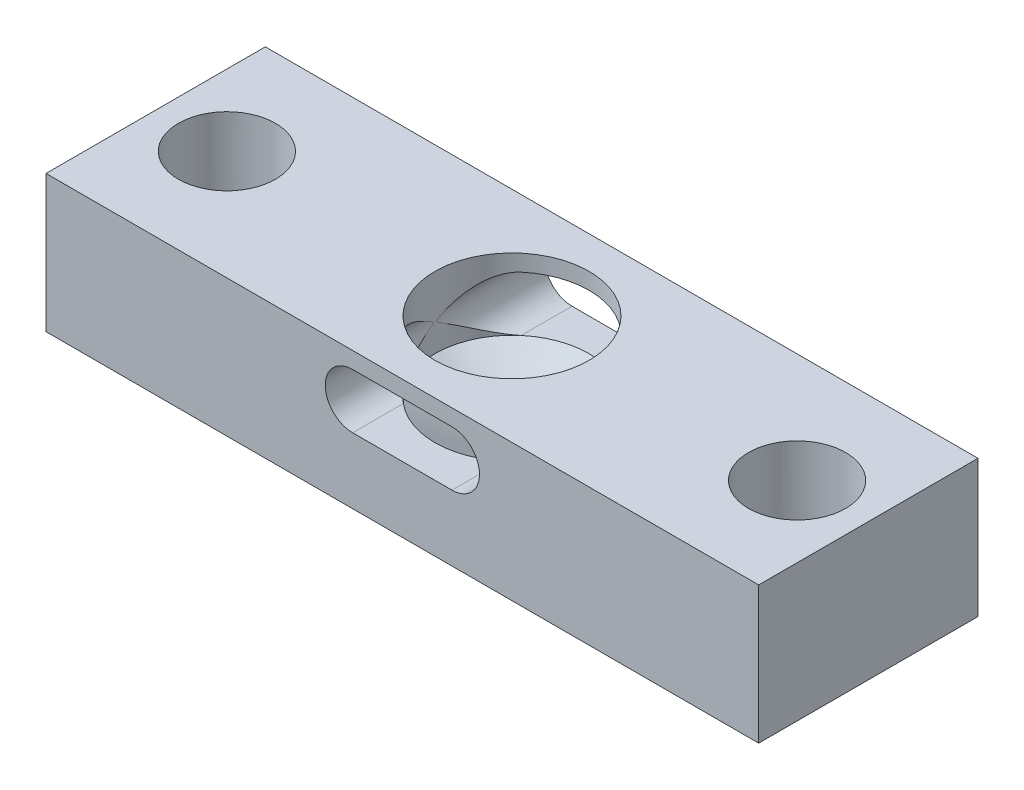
from build123d import *

# Parameters (mm, degrees)
SKETCH1_W                           = 33.02
SKETCH1_H                           = 12.7
BOSS_EXTRUDE1_DEPTH                 = 10.16
F_16_0_177_DIAMETER_HOLE1_D         = 4.4958
F_9_32_0_28125_DIAMETER_HOLE1_D     = 7.14375
F_9_32_0_28125_DIAMETER_HOLE1_DEPTH = 3.302
F_9_32_0_28125_DIAMETER_HOLE1_TIP   = 2.146199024
CUT_EXTRUDE1_DEPTH                  = 38.043044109
SKETCH13_W                          = 33.02
SKETCH13_H                          = 6.35
CUT_EXTRUDE2_DEPTH                  = 38.043044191


with BuildPart() as part:
    # Sketch1 → Boss-Extrude1 (new body)
    with BuildSketch(Plane.XY):
        with Locations((-12.849206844, 13.824203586)):
            Rectangle(SKETCH1_W, SKETCH1_H)
    extrude(amount=BOSS_EXTRUDE1_DEPTH)

    # 16 _0.177_ Diameter Hole1 (through all)
    with Locations(Plane(origin=(0, 20.174203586, 0), x_dir=(1, 0, 0), z_dir=(0, 1, 0))):
        with Locations((-26.057206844, -5.08), (0.358793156, -5.08)):
            Hole(F_16_0_177_DIAMETER_HOLE1_D / 2)

    # 9_32 _0.28125_ Diameter Hole1
    with Locations(Plane(origin=(0, 20.174203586, 0), x_dir=(1, 0, 0), z_dir=(0, 1, 0))):
        with Locations((-12.849206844, -5.08)):
            Hole(F_9_32_0_28125_DIAMETER_HOLE1_D / 2, depth=F_9_32_0_28125_DIAMETER_HOLE1_DEPTH)
            with Locations((0, 0, -(F_9_32_0_28125_DIAMETER_HOLE1_DEPTH + F_9_32_0_28125_DIAMETER_HOLE1_TIP / 2))):  # 118° drill point
                Cone(0, F_9_32_0_28125_DIAMETER_HOLE1_D / 2, F_9_32_0_28125_DIAMETER_HOLE1_TIP, mode=Mode.SUBTRACT)

    # Sketch12 → Cut-Extrude1 (cut, through all)
    with BuildSketch(Plane.XY.offset(10.16)):
        with BuildLine():
            Line((-15.150446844, 19.412203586), (-10.547966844, 19.412203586))
            ThreePointArc((-10.547966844, 19.412203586), (-9.277966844, 18.142203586), (-10.547966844, 16.872203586))
            Line((-10.547966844, 16.872203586), (-15.150446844, 16.872203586))
            ThreePointArc((-15.150446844, 16.872203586), (-16.420446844, 18.142203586), (-15.150446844, 19.412203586))
        make_face()
    extrude(amount=-CUT_EXTRUDE1_DEPTH, mode=Mode.SUBTRACT)

    # Sketch13 → Cut-Extrude2 (cut, through all)
    with BuildSketch(Plane.XY.offset(10.16)):
        with Locations((-12.849206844, 10.649203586)):
            Rectangle(SKETCH13_W, SKETCH13_H)
    extrude(amount=-CUT_EXTRUDE2_DEPTH, mode=Mode.SUBTRACT)


solid = part.part
